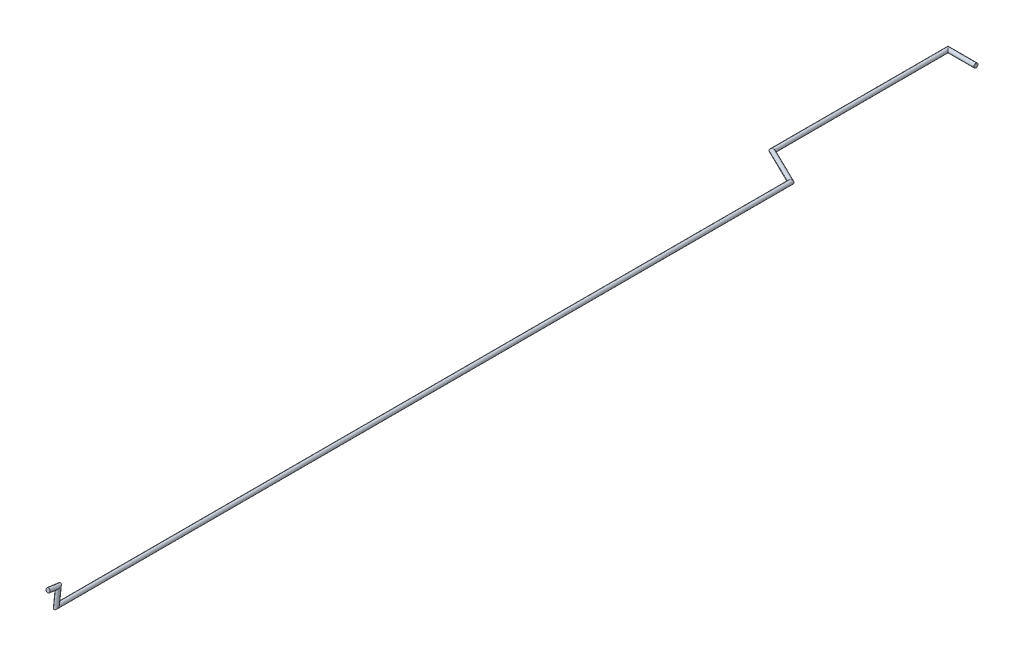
from build123d import *

# Parameters (mm, degrees)
ESQUISSE1_R = 0.6


with BuildPart() as part:
    # Balayage1: sweep along a curve in space
    with BuildLine() as balayage1_path:
        Line((0, 0, 0), (-8.1, 0, 0))
        Line((-8.1, 0, 0), (-8.1, 0, 51))
        Line((-8.1, 0, 51), (2.4, 0, 56.12119218))
        Line((2.4, 0, 56.12119218), (2.4, 0, 269.17119218))
        Line((2.4, 0, 269.17119218), (2.4, 4.741915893, 268.640139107))
        Line((2.4, 4.741915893, 268.640139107), (2.4, 5.151959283, 271.611984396))
    # Esquisse1 → Balayage1 (sweep)
    with BuildSketch(Plane(origin=(0, 0, 0), x_dir=(0, 0, -1), z_dir=(1, 0, 0))):
        Circle(ESQUISSE1_R)
    sweep(path=balayage1_path.line, transition=Transition.RIGHT)


solid = part.part
